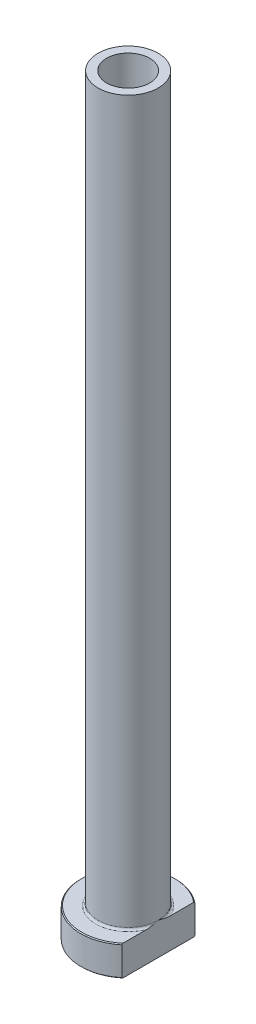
from build123d import *

# Parameters (mm, degrees)
FILLET1_R          = 0.5
CHAMFER1_SIZE      = 0.2
CUT_EXTRUDE1_DEPTH = 176.690068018
CHAMFER2_SIZE      = 0.5


with BuildPart() as part:
    # Sketch1 → Revolve1 (revolve)
    with BuildSketch(Plane.XY, mode=Mode.PRIVATE) as revolve1_sk:
        Polygon((-5, 175), (-7, 175), (-7, 7), (-11, 7), (-11, 0), (-5.25, 0), (-5.25, 118), (-5, 130), align=None)
    revolve(revolve1_sk.sketch.rotate(Axis((0, 92.187680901, 0), (0, -1, 0)), 270), axis=Axis((0, 92.187680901, 0), (0, -1, 0)))

    # Fillet1
    fillet1_edges = [part.edges().sort_by_distance(p)[0] for p in [
        (0, 7, -7),
    ]]
    fillet(fillet1_edges, radius=FILLET1_R)

    # Chamfer1
    chamfer1_edges = [part.edges().sort_by_distance(p)[0] for p in [
        (0, 0, -11),
        (0, 7, -11),
    ]]
    chamfer(chamfer1_edges, length=CHAMFER1_SIZE)

    # Sketch2 → Cut-Extrude1 (cut, through all)
    with BuildSketch(Plane.XZ):
        with BuildLine():
            Line((7, 8.485281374), (7, -8.485281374))
            ThreePointArc((7, -8.485281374), (11, 0), (7, 8.485281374))
        make_face()
    extrude(amount=-CUT_EXTRUDE1_DEPTH, mode=Mode.SUBTRACT)

    # Chamfer2
    chamfer2_edges = [part.edges().sort_by_distance(p)[0] for p in [
        (0, 0, -5.25),
    ]]
    chamfer(chamfer2_edges, length=CHAMFER2_SIZE)


solid = part.part
